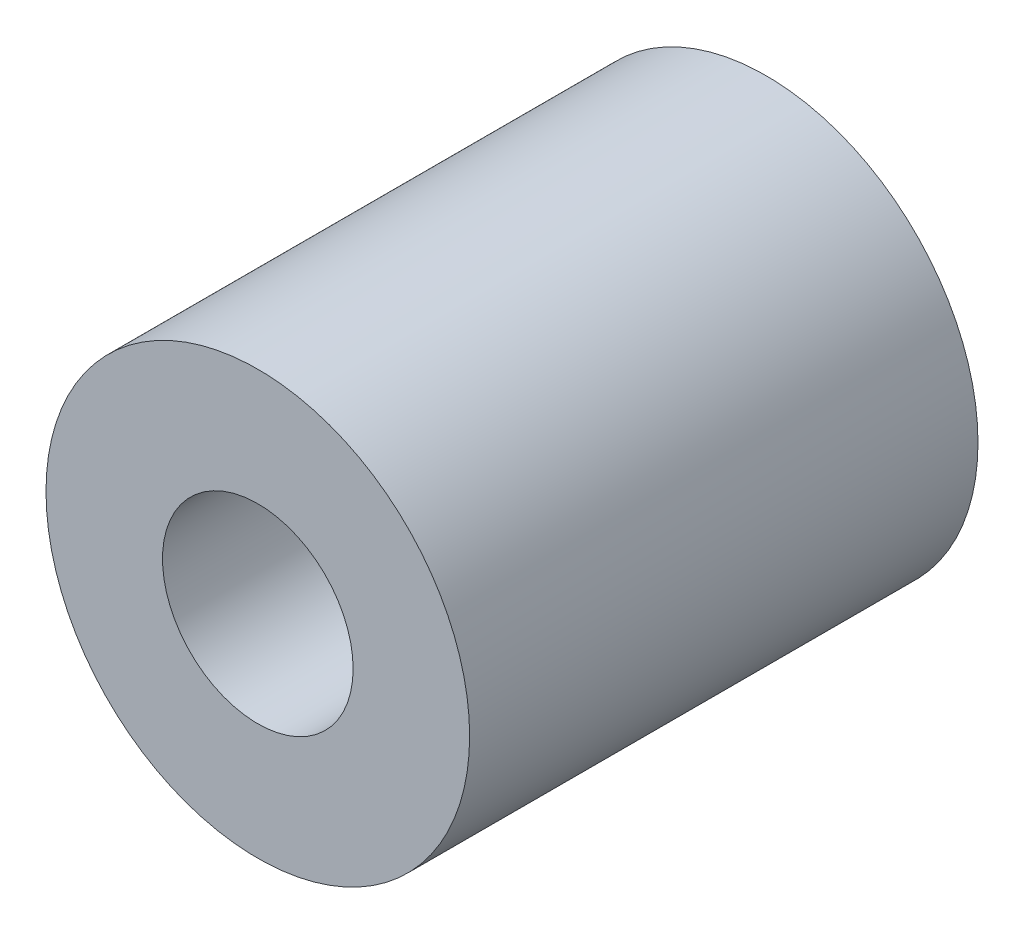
from build123d import *

# Parameters (mm, degrees)
SKETCH1_R      = 5
SKETCH1_R_2    = 2.25
EXTRUDE1_DEPTH = 12


with BuildPart() as part:
    # Sketch1 → Extrude1 (new body)
    with BuildSketch(Plane.XY):
        Circle(SKETCH1_R)
        Circle(SKETCH1_R_2, mode=Mode.SUBTRACT)
    extrude(amount=EXTRUDE1_DEPTH)


solid = part.part
